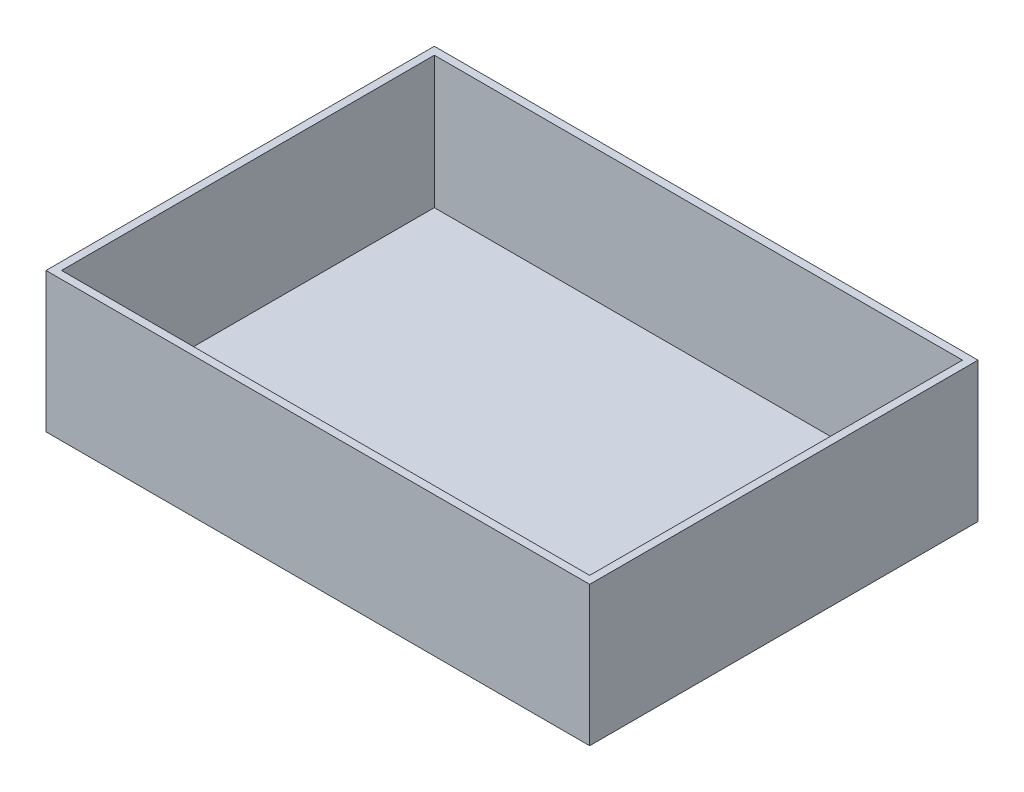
from build123d import *

# Parameters (mm, degrees)
CROQUIS1_W              = 700
CROQUIS1_H              = 180
SALIENTE_EXTRUIR1_DEPTH = 500
VACIADO1_T              = -10


with BuildPart() as part:
    # Croquis1 → Saliente-Extruir1 (new body)
    with BuildSketch(Plane.XY):
        with Locations((-14.202898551, 144.347826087)):
            Rectangle(CROQUIS1_W, CROQUIS1_H)
    extrude(amount=SALIENTE_EXTRUIR1_DEPTH)

    # Vaciado1
    vaciado1_openings = [part.faces().sort_by_distance(p)[0] for p in [
        (-14.202898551, 234.347826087, 250),
    ]]
    offset(amount=VACIADO1_T, openings=vaciado1_openings, kind=Kind.INTERSECTION)


solid = part.part
